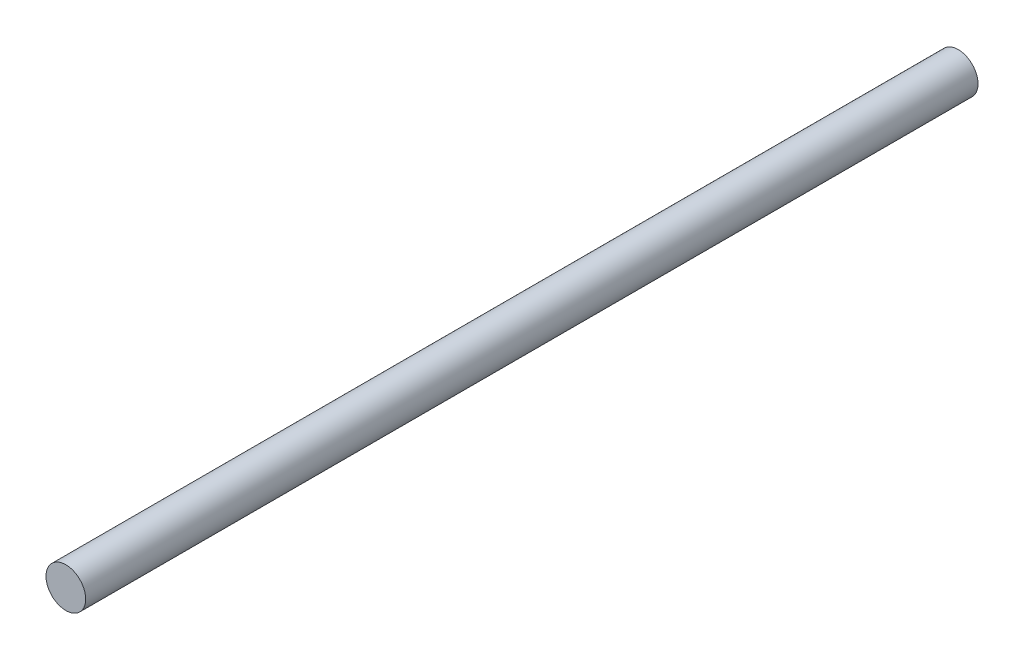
ISO-10303-21;
HEADER;
FILE_DESCRIPTION(('STEP AP214'),'2;1');
FILE_NAME('part.step','',(''),(''),'','','');
FILE_SCHEMA(('AUTOMOTIVE_DESIGN { 1 0 10303 214 1 1 1 1 }'));
ENDSEC;
DATA;
#1=APPLICATION_CONTEXT('core data for automotive mechanical design processes');
#2=APPLICATION_PROTOCOL_DEFINITION('international standard','automotive_design',2000,#1);
#3=PRODUCT_CONTEXT('',#1,'mechanical');
#4=PRODUCT('Part','Part','',(#3));
#5=PRODUCT_RELATED_PRODUCT_CATEGORY('part','',(#4));
#6=PRODUCT_DEFINITION_FORMATION('','',#4);
#7=PRODUCT_DEFINITION_CONTEXT('part definition',#1,'design');
#8=PRODUCT_DEFINITION('design','',#6,#7);
#9=PRODUCT_DEFINITION_SHAPE('','',#8);
#10=(LENGTH_UNIT() NAMED_UNIT(*) SI_UNIT(.MILLI.,.METRE.));
#11=(NAMED_UNIT(*) PLANE_ANGLE_UNIT() SI_UNIT($,.RADIAN.));
#12=(NAMED_UNIT(*) SI_UNIT($,.STERADIAN.) SOLID_ANGLE_UNIT());
#13=UNCERTAINTY_MEASURE_WITH_UNIT(LENGTH_MEASURE(1.E-05),#10,'distance_accuracy_value','');
#14=(GEOMETRIC_REPRESENTATION_CONTEXT(3) GLOBAL_UNCERTAINTY_ASSIGNED_CONTEXT((#13)) GLOBAL_UNIT_ASSIGNED_CONTEXT((#10,
#11,#12)) REPRESENTATION_CONTEXT('',''));
#15=CARTESIAN_POINT('',(0.,0.,0.));
#16=DIRECTION('',(0.,0.,1.));
#17=DIRECTION('',(1.,0.,0.));
#18=AXIS2_PLACEMENT_3D('',#15,#16,#17);
#19=CARTESIAN_POINT('',(0.,0.,22.5));
#20=DIRECTION('',(0.,0.,-1.));
#21=DIRECTION('',(-1.,0.,0.));
#22=AXIS2_PLACEMENT_3D('',#19,#20,#21);
#23=CYLINDRICAL_SURFACE('',#22,1.);
#24=CARTESIAN_POINT('',(0.,0.,22.5));
#25=DIRECTION('',(0.,0.,1.));
#26=DIRECTION('',(1.,0.,0.));
#27=AXIS2_PLACEMENT_3D('',#24,#25,#26);
#28=CIRCLE('',#27,1.);
#29=CARTESIAN_POINT('',(-1.,0.,22.5));
#30=VERTEX_POINT('',#29);
#31=EDGE_CURVE('E10',#30,#30,#28,.T.);
#32=CARTESIAN_POINT('',(0.,0.,-22.5));
#33=DIRECTION('',(0.,0.,1.));
#34=DIRECTION('',(1.,0.,0.));
#35=AXIS2_PLACEMENT_3D('',#32,#33,#34);
#36=CIRCLE('',#35,1.);
#37=CARTESIAN_POINT('',(-1.,0.,-22.5));
#38=VERTEX_POINT('',#37);
#39=EDGE_CURVE('E44',#38,#38,#36,.T.);
#40=CARTESIAN_POINT('',(-1.,0.,22.5));
#41=CARTESIAN_POINT('',(-1.,0.,22.03125));
#42=CARTESIAN_POINT('',(-1.,0.,21.5625));
#43=CARTESIAN_POINT('',(-1.,0.,20.625));
#44=CARTESIAN_POINT('',(-1.,0.,20.15625));
#45=CARTESIAN_POINT('',(-1.,0.,19.21875));
#46=CARTESIAN_POINT('',(-1.,0.,18.75));
#47=CARTESIAN_POINT('',(-1.,0.,17.8125));
#48=CARTESIAN_POINT('',(-1.,0.,17.34375));
#49=CARTESIAN_POINT('',(-1.,0.,16.40625));
#50=CARTESIAN_POINT('',(-1.,0.,15.9375));
#51=CARTESIAN_POINT('',(-1.,0.,15.));
#52=CARTESIAN_POINT('',(-1.,0.,14.53125));
#53=CARTESIAN_POINT('',(-1.,0.,13.59375));
#54=CARTESIAN_POINT('',(-1.,0.,13.125));
#55=CARTESIAN_POINT('',(-1.,0.,12.1875));
#56=CARTESIAN_POINT('',(-1.,0.,11.71875));
#57=CARTESIAN_POINT('',(-1.,0.,10.78125));
#58=CARTESIAN_POINT('',(-1.,0.,10.3125));
#59=CARTESIAN_POINT('',(-1.,0.,9.37499999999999));
#60=CARTESIAN_POINT('',(-1.,0.,8.90625));
#61=CARTESIAN_POINT('',(-1.,0.,7.96874999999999));
#62=CARTESIAN_POINT('',(-1.,0.,7.5));
#63=CARTESIAN_POINT('',(-1.,0.,6.5625));
#64=CARTESIAN_POINT('',(-1.,0.,6.09374999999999));
#65=CARTESIAN_POINT('',(-1.,0.,5.15624999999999));
#66=CARTESIAN_POINT('',(-1.,0.,4.68749999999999));
#67=CARTESIAN_POINT('',(-1.,0.,3.74999999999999));
#68=CARTESIAN_POINT('',(-1.,0.,3.28124999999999));
#69=CARTESIAN_POINT('',(-1.,0.,2.34375));
#70=CARTESIAN_POINT('',(-1.,0.,1.87499999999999));
#71=CARTESIAN_POINT('',(-1.,0.,0.937499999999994));
#72=CARTESIAN_POINT('',(-1.,0.,0.468749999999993));
#73=CARTESIAN_POINT('',(-1.,0.,-0.468750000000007));
#74=CARTESIAN_POINT('',(-1.,0.,-0.937500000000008));
#75=CARTESIAN_POINT('',(-1.,0.,-1.87500000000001));
#76=CARTESIAN_POINT('',(-1.,0.,-2.34375000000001));
#77=CARTESIAN_POINT('',(-1.,0.,-3.28125000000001));
#78=CARTESIAN_POINT('',(-1.,0.,-3.75000000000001));
#79=CARTESIAN_POINT('',(-1.,0.,-4.68750000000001));
#80=CARTESIAN_POINT('',(-1.,0.,-5.15625000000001));
#81=CARTESIAN_POINT('',(-1.,0.,-6.09375000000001));
#82=CARTESIAN_POINT('',(-1.,0.,-6.56250000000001));
#83=CARTESIAN_POINT('',(-1.,0.,-7.50000000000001));
#84=CARTESIAN_POINT('',(-1.,0.,-7.96875000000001));
#85=CARTESIAN_POINT('',(-1.,0.,-8.90625000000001));
#86=CARTESIAN_POINT('',(-1.,0.,-9.37500000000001));
#87=CARTESIAN_POINT('',(-1.,0.,-10.3125));
#88=CARTESIAN_POINT('',(-1.,0.,-10.78125));
#89=CARTESIAN_POINT('',(-1.,0.,-11.71875));
#90=CARTESIAN_POINT('',(-1.,0.,-12.1875));
#91=CARTESIAN_POINT('',(-1.,0.,-13.125));
#92=CARTESIAN_POINT('',(-1.,0.,-13.59375));
#93=CARTESIAN_POINT('',(-1.,0.,-14.53125));
#94=CARTESIAN_POINT('',(-1.,0.,-15.));
#95=CARTESIAN_POINT('',(-1.,0.,-15.9375));
#96=CARTESIAN_POINT('',(-1.,0.,-16.40625));
#97=CARTESIAN_POINT('',(-1.,0.,-17.34375));
#98=CARTESIAN_POINT('',(-1.,0.,-17.8125));
#99=CARTESIAN_POINT('',(-1.,0.,-18.75));
#100=CARTESIAN_POINT('',(-1.,0.,-19.21875));
#101=CARTESIAN_POINT('',(-1.,0.,-20.15625));
#102=CARTESIAN_POINT('',(-1.,0.,-20.625));
#103=CARTESIAN_POINT('',(-1.,0.,-21.5625));
#104=CARTESIAN_POINT('',(-1.,0.,-22.03125));
#105=CARTESIAN_POINT('',(-1.,0.,-22.5));
#106=B_SPLINE_CURVE_WITH_KNOTS('',3,(#40,#41,#42,#43,#44,#45,#46,#47,#48,#49,#50,#51,#52,#53,
#54,#55,#56,#57,#58,#59,#60,#61,#62,#63,#64,#65,#66,#67,#68,#69,#70,#71,#72,#73,#74,#75,#76,#77,
#78,#79,#80,#81,#82,#83,#84,#85,#86,#87,#88,#89,#90,#91,#92,#93,#94,#95,#96,#97,#98,#99,#100,
#101,#102,#103,#104,#105),.UNSPECIFIED.,.F.,.F.,(4,2,2,2,2,2,2,2,2,2,2,2,2,2,2,2,2,2,2,2,2,2,2,
2,2,2,2,2,2,2,2,2,4),(0.,1.40625,2.8125,4.21875,5.625,7.03125,8.4375,9.84375,11.25,12.65625,
14.0625,15.46875,16.875,18.28125,19.6875,21.09375,22.5,23.90625,25.3125,26.71875,28.125,
29.53125,30.9375,32.34375,33.75,35.15625,36.5625,37.96875,39.375,40.78125,42.1875,43.59375,45.),.UNSPECIFIED.);
#107=EDGE_CURVE('BSEAM41',#30,#38,#106,.T.);
#108=ORIENTED_EDGE('',*,*,#31,.F.);
#109=ORIENTED_EDGE('',*,*,#39,.T.);
#110=ORIENTED_EDGE('',*,*,#107,.T.);
#111=ORIENTED_EDGE('',*,*,#107,.F.);
#112=EDGE_LOOP('',(#108,#110,#109,#111));
#113=FACE_BOUND('',#112,.T.);
#114=ADVANCED_FACE('F41',(#113),#23,.T.);
#115=CARTESIAN_POINT('',(0.,0.,22.5));
#116=DIRECTION('',(0.,0.,1.));
#117=DIRECTION('',(1.,0.,0.));
#118=AXIS2_PLACEMENT_3D('',#115,#116,#117);
#119=PLANE('',#118);
#120=ORIENTED_EDGE('',*,*,#31,.T.);
#121=EDGE_LOOP('',(#120));
#122=FACE_BOUND('',#121,.T.);
#123=ADVANCED_FACE('F58',(#122),#119,.T.);
#124=CARTESIAN_POINT('',(0.,0.,-22.5));
#125=DIRECTION('',(0.,0.,1.));
#126=DIRECTION('',(1.,0.,0.));
#127=AXIS2_PLACEMENT_3D('',#124,#125,#126);
#128=PLANE('',#127);
#129=ORIENTED_EDGE('',*,*,#39,.F.);
#130=EDGE_LOOP('',(#129));
#131=FACE_BOUND('',#130,.T.);
#132=ADVANCED_FACE('F56',(#131),#128,.F.);
#133=CLOSED_SHELL('',(#114,#123,#132));
#134=MANIFOLD_SOLID_BREP('B2',#133);
#135=ADVANCED_BREP_SHAPE_REPRESENTATION('',(#18,#134),#14);
#136=SHAPE_DEFINITION_REPRESENTATION(#9,#135);
ENDSEC;
END-ISO-10303-21;
